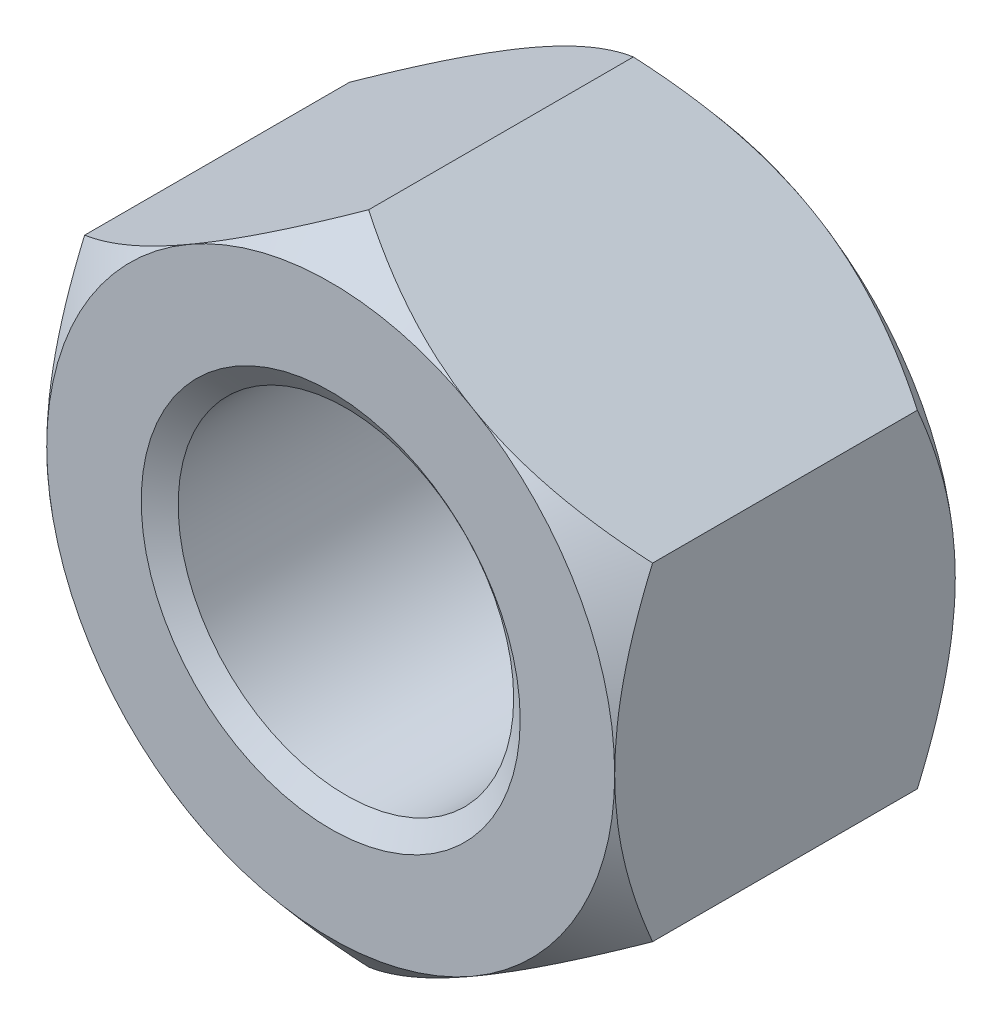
ISO-10303-21;
HEADER;
FILE_DESCRIPTION(('STEP AP214'),'2;1');
FILE_NAME('part.step','',(''),(''),'','','');
FILE_SCHEMA(('AUTOMOTIVE_DESIGN { 1 0 10303 214 1 1 1 1 }'));
ENDSEC;
DATA;
#1=APPLICATION_CONTEXT('core data for automotive mechanical design processes');
#2=APPLICATION_PROTOCOL_DEFINITION('international standard','automotive_design',2000,#1);
#3=PRODUCT_CONTEXT('',#1,'mechanical');
#4=PRODUCT('Part','Part','',(#3));
#5=PRODUCT_RELATED_PRODUCT_CATEGORY('part','',(#4));
#6=PRODUCT_DEFINITION_FORMATION('','',#4);
#7=PRODUCT_DEFINITION_CONTEXT('part definition',#1,'design');
#8=PRODUCT_DEFINITION('design','',#6,#7);
#9=PRODUCT_DEFINITION_SHAPE('','',#8);
#10=(LENGTH_UNIT() NAMED_UNIT(*) SI_UNIT(.MILLI.,.METRE.));
#11=(NAMED_UNIT(*) PLANE_ANGLE_UNIT() SI_UNIT($,.RADIAN.));
#12=(NAMED_UNIT(*) SI_UNIT($,.STERADIAN.) SOLID_ANGLE_UNIT());
#13=UNCERTAINTY_MEASURE_WITH_UNIT(LENGTH_MEASURE(1.E-05),#10,'distance_accuracy_value','');
#14=(GEOMETRIC_REPRESENTATION_CONTEXT(3) GLOBAL_UNCERTAINTY_ASSIGNED_CONTEXT((#13)) GLOBAL_UNIT_ASSIGNED_CONTEXT((#10,
#11,#12)) REPRESENTATION_CONTEXT('',''));
#15=CARTESIAN_POINT('',(0.,0.,0.));
#16=DIRECTION('',(0.,0.,1.));
#17=DIRECTION('',(1.,0.,0.));
#18=AXIS2_PLACEMENT_3D('',#15,#16,#17);
#19=CARTESIAN_POINT('',(0.,0.,-8.5598));
#20=DIRECTION('',(0.,0.,1.));
#21=DIRECTION('',(1.,0.,0.));
#22=AXIS2_PLACEMENT_3D('',#19,#20,#21);
#23=CYLINDRICAL_SURFACE('',#22,4.2164);
#24=CARTESIAN_POINT('',(0.,0.,-0.382383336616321));
#25=DIRECTION('',(0.,0.,1.));
#26=DIRECTION('',(1.,0.,0.));
#27=AXIS2_PLACEMENT_3D('',#24,#25,#26);
#28=CIRCLE('',#27,4.2164);
#29=CARTESIAN_POINT('',(4.2164,0.,-0.382383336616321));
#30=VERTEX_POINT('',#29);
#31=EDGE_CURVE('E173',#30,#30,#28,.F.);
#32=ORIENTED_EDGE('',*,*,#31,.F.);
#33=EDGE_LOOP('',(#32));
#34=FACE_BOUND('',#33,.T.);
#35=CARTESIAN_POINT('',(0.,0.,-8.15201666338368));
#36=DIRECTION('',(0.,0.,-1.));
#37=DIRECTION('',(-1.,0.,0.));
#38=AXIS2_PLACEMENT_3D('',#35,#36,#37);
#39=CIRCLE('',#38,4.2164);
#40=CARTESIAN_POINT('',(-4.2164,0.,-8.15201666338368));
#41=VERTEX_POINT('',#40);
#42=EDGE_CURVE('E37',#41,#41,#39,.F.);
#43=ORIENTED_EDGE('',*,*,#42,.F.);
#44=EDGE_LOOP('',(#43));
#45=FACE_BOUND('',#44,.T.);
#46=ADVANCED_FACE('F32',(#34,#45),#23,.F.);
#47=CARTESIAN_POINT('',(-14.2748,0.,-8.5598));
#48=DIRECTION('',(0.,0.,1.));
#49=DIRECTION('',(1.,0.,0.));
#50=AXIS2_PLACEMENT_3D('',#47,#48,#49);
#51=PLANE('',#50);
#52=CARTESIAN_POINT('',(0.,0.,-8.5598));
#53=DIRECTION('',(0.,0.,1.));
#54=DIRECTION('',(1.,0.,0.));
#55=AXIS2_PLACEMENT_3D('',#52,#53,#54);
#56=CIRCLE('',#55,7.1374);
#57=CARTESIAN_POINT('',(7.1374,0.,-8.5598));
#58=VERTEX_POINT('',#57);
#59=CARTESIAN_POINT('',(3.56870000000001,6.18116971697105,-8.5598));
#60=VERTEX_POINT('',#59);
#61=EDGE_CURVE('E243',#58,#60,#56,.T.);
#62=ORIENTED_EDGE('',*,*,#61,.F.);
#63=CARTESIAN_POINT('',(0.,0.,-8.5598));
#64=DIRECTION('',(0.,0.,1.));
#65=DIRECTION('',(1.,0.,0.));
#66=AXIS2_PLACEMENT_3D('',#63,#64,#65);
#67=CIRCLE('',#66,7.1374);
#68=CARTESIAN_POINT('',(3.56870000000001,-6.18116971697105,-8.5598));
#69=VERTEX_POINT('',#68);
#70=EDGE_CURVE('E167',#58,#69,#67,.F.);
#71=ORIENTED_EDGE('',*,*,#70,.T.);
#72=CARTESIAN_POINT('',(-3.56870000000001,-6.18116971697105,-8.5598));
#73=VERTEX_POINT('',#72);
#74=EDGE_CURVE('E169',#69,#73,#67,.F.);
#75=ORIENTED_EDGE('',*,*,#74,.T.);
#76=CARTESIAN_POINT('',(-7.1374,0.,-8.5598));
#77=VERTEX_POINT('',#76);
#78=EDGE_CURVE('E400',#73,#77,#67,.F.);
#79=ORIENTED_EDGE('',*,*,#78,.T.);
#80=CARTESIAN_POINT('',(-3.56870000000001,6.18116971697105,-8.5598));
#81=VERTEX_POINT('',#80);
#82=EDGE_CURVE('E402',#77,#81,#67,.F.);
#83=ORIENTED_EDGE('',*,*,#82,.T.);
#84=EDGE_CURVE('E151',#81,#60,#67,.F.);
#85=ORIENTED_EDGE('',*,*,#84,.T.);
#86=EDGE_LOOP('',(#62,#71,#75,#79,#83,#85));
#87=FACE_BOUND('',#86,.T.);
#88=CARTESIAN_POINT('',(0.,0.,-8.5598));
#89=DIRECTION('',(0.,0.,1.));
#90=DIRECTION('',(1.,0.,0.));
#91=AXIS2_PLACEMENT_3D('',#88,#89,#90);
#92=CIRCLE('',#91,4.7625);
#93=CARTESIAN_POINT('',(4.7625,0.,-8.5598));
#94=VERTEX_POINT('',#93);
#95=EDGE_CURVE('E176',#94,#94,#92,.F.);
#96=ORIENTED_EDGE('',*,*,#95,.F.);
#97=EDGE_LOOP('',(#96));
#98=FACE_BOUND('',#97,.T.);
#99=ADVANCED_FACE('F295',(#87,#98),#51,.F.);
#100=CARTESIAN_POINT('',(-14.2748,0.,0.));
#101=DIRECTION('',(0.,0.,1.));
#102=DIRECTION('',(1.,0.,0.));
#103=AXIS2_PLACEMENT_3D('',#100,#101,#102);
#104=PLANE('',#103);
#105=CARTESIAN_POINT('',(0.,0.,0.));
#106=DIRECTION('',(0.,0.,1.));
#107=DIRECTION('',(1.,0.,0.));
#108=AXIS2_PLACEMENT_3D('',#105,#106,#107);
#109=CIRCLE('',#108,7.1374);
#110=CARTESIAN_POINT('',(3.56870000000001,-6.18116971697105,0.));
#111=VERTEX_POINT('',#110);
#112=CARTESIAN_POINT('',(7.1374,0.,0.));
#113=VERTEX_POINT('',#112);
#114=EDGE_CURVE('E44',#111,#113,#109,.T.);
#115=ORIENTED_EDGE('',*,*,#114,.T.);
#116=CARTESIAN_POINT('',(0.,0.,0.));
#117=DIRECTION('',(0.,0.,1.));
#118=DIRECTION('',(1.,0.,0.));
#119=AXIS2_PLACEMENT_3D('',#116,#117,#118);
#120=CIRCLE('',#119,7.1374);
#121=CARTESIAN_POINT('',(3.56870000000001,6.18116971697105,0.));
#122=VERTEX_POINT('',#121);
#123=EDGE_CURVE('E51',#113,#122,#120,.T.);
#124=ORIENTED_EDGE('',*,*,#123,.T.);
#125=CARTESIAN_POINT('',(-3.56870000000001,6.18116971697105,0.));
#126=VERTEX_POINT('',#125);
#127=EDGE_CURVE('E11',#122,#126,#109,.T.);
#128=ORIENTED_EDGE('',*,*,#127,.T.);
#129=CARTESIAN_POINT('',(-7.1374,0.,0.));
#130=VERTEX_POINT('',#129);
#131=EDGE_CURVE('E42',#126,#130,#109,.T.);
#132=ORIENTED_EDGE('',*,*,#131,.T.);
#133=CARTESIAN_POINT('',(-3.56870000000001,-6.18116971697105,0.));
#134=VERTEX_POINT('',#133);
#135=EDGE_CURVE('E346',#130,#134,#109,.T.);
#136=ORIENTED_EDGE('',*,*,#135,.T.);
#137=EDGE_CURVE('E172',#134,#111,#109,.T.);
#138=ORIENTED_EDGE('',*,*,#137,.T.);
#139=EDGE_LOOP('',(#115,#124,#128,#132,#136,#138));
#140=FACE_BOUND('',#139,.T.);
#141=CARTESIAN_POINT('',(0.,0.,0.));
#142=DIRECTION('',(0.,0.,1.));
#143=DIRECTION('',(1.,0.,0.));
#144=AXIS2_PLACEMENT_3D('',#141,#142,#143);
#145=CIRCLE('',#144,4.7625);
#146=CARTESIAN_POINT('',(4.7625,0.,0.));
#147=VERTEX_POINT('',#146);
#148=EDGE_CURVE('E175',#147,#147,#145,.T.);
#149=ORIENTED_EDGE('',*,*,#148,.F.);
#150=EDGE_LOOP('',(#149));
#151=FACE_BOUND('',#150,.T.);
#152=ADVANCED_FACE('F248',(#140,#151),#104,.T.);
#153=CARTESIAN_POINT('',(0.,8.24155962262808,-8.5598));
#154=DIRECTION('',(-0.500000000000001,0.866025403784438,0.));
#155=DIRECTION('',(-0.866025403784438,-0.500000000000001,0.));
#156=AXIS2_PLACEMENT_3D('',#153,#154,#155);
#157=PLANE('',#156);
#158=DIRECTION('',(0.,0.,1.));
#159=VECTOR('',#158,1.);
#160=CARTESIAN_POINT('',(-7.1374,4.12077981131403,-8.5598));
#161=LINE('',#160,#159);
#162=CARTESIAN_POINT('',(-7.1374,4.12077981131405,-7.6073));
#163=VERTEX_POINT('',#162);
#164=CARTESIAN_POINT('',(-7.1374,4.12077981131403,-0.952499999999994));
#165=VERTEX_POINT('',#164);
#166=EDGE_CURVE('E163',#163,#165,#161,.T.);
#167=ORIENTED_EDGE('',*,*,#166,.T.);
#168=CARTESIAN_POINT('',(-7.1376,4.12066434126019,-0.952599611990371));
#169=CARTESIAN_POINT('',(-6.99772936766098,4.20141868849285,-0.882951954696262));
#170=CARTESIAN_POINT('',(-6.85691392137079,4.28271852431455,-0.815871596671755));
#171=CARTESIAN_POINT('',(-6.57317892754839,4.44653299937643,-0.687649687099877));
#172=CARTESIAN_POINT('',(-6.43025819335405,4.52904832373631,-0.626511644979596));
#173=CARTESIAN_POINT('',(-5.99690370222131,4.77924565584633,-0.452792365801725));
#174=CARTESIAN_POINT('',(-5.70319714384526,4.9488172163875,-0.350580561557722));
#175=CARTESIAN_POINT('',(-5.25966772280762,5.2048890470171,-0.224711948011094));
#176=CARTESIAN_POINT('',(-5.11266966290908,5.28975841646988,-0.187546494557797));
#177=CARTESIAN_POINT('',(-4.81712495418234,5.46039123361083,-0.122687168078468));
#178=CARTESIAN_POINT('',(-4.66857866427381,5.54615447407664,-0.0949911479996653));
#179=CARTESIAN_POINT('',(-4.37062850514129,5.7181760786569,-0.0498719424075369));
#180=CARTESIAN_POINT('',(-4.22122705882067,5.80443304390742,-0.032427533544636));
#181=CARTESIAN_POINT('',(-3.9217766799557,5.97732080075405,-0.00824572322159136));
#182=CARTESIAN_POINT('',(-3.77172779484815,6.0639515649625,-0.00150755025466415));
#183=CARTESIAN_POINT('',(-3.49251730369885,6.22515381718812,0.000876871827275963));
#184=CARTESIAN_POINT('',(-3.36336331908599,6.29972090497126,-0.00206006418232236));
#185=CARTESIAN_POINT('',(-3.10536355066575,6.44867714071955,-0.015940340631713));
#186=CARTESIAN_POINT('',(-2.97651780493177,6.523066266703,-0.0268846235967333));
#187=CARTESIAN_POINT('',(-2.71942449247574,6.67149915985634,-0.0565424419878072));
#188=CARTESIAN_POINT('',(-2.59117732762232,6.74554269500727,-0.0752605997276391));
#189=CARTESIAN_POINT('',(-2.33564422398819,6.8930748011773,-0.1200622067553));
#190=CARTESIAN_POINT('',(-2.2083584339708,6.96656328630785,-0.146146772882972));
#191=CARTESIAN_POINT('',(-1.82829381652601,7.18599369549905,-0.234706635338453));
#192=CARTESIAN_POINT('',(-1.57728830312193,7.33091179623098,-0.307490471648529));
#193=CARTESIAN_POINT('',(-1.08128197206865,7.61728118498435,-0.475766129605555));
#194=CARTESIAN_POINT('',(-0.836279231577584,7.75873358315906,-0.571250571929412));
#195=CARTESIAN_POINT('',(-0.494067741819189,7.95630947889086,-0.719062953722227));
#196=CARTESIAN_POINT('',(-0.394372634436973,8.01386847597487,-0.763897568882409));
#197=CARTESIAN_POINT('',(-0.196230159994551,8.1282660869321,-0.856270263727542));
#198=CARTESIAN_POINT('',(-0.097780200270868,8.18510619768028,-0.903800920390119));
#199=CARTESIAN_POINT('',(0.000200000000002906,8.24167509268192,-0.952599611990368));
#200=B_SPLINE_CURVE_WITH_KNOTS('',3,(#168,#169,#170,#171,#172,#173,#174,#175,#176,#177,#178,
#179,#180,#181,#182,#183,#184,#185,#186,#187,#188,#189,#190,#191,#192,#193,#194,#195,#196,#197,
#198,#199),.UNSPECIFIED.,.F.,.F.,(4,2,2,2,2,2,2,2,2,2,2,2,2,2,2,4),(0.,0.527589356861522,
1.05548842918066,2.11627342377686,2.63733905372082,3.15828646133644,3.67815154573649,
4.19797916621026,4.64525595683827,5.09258540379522,5.54018121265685,5.98784491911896,
6.88310490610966,7.77807426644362,8.14866892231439,8.51828856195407),.UNSPECIFIED.);
#201=EDGE_CURVE('E59',#165,#126,#200,.T.);
#202=ORIENTED_EDGE('',*,*,#201,.T.);
#203=CARTESIAN_POINT('',(0.,8.24155962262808,-0.952500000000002));
#204=VERTEX_POINT('',#203);
#205=EDGE_CURVE('E237',#126,#204,#200,.T.);
#206=ORIENTED_EDGE('',*,*,#205,.T.);
#207=DIRECTION('',(0.,0.,1.));
#208=VECTOR('',#207,1.);
#209=CARTESIAN_POINT('',(0.,8.24155962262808,-8.5598));
#210=LINE('',#209,#208);
#211=CARTESIAN_POINT('',(0.,8.24155962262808,-7.6073));
#212=VERTEX_POINT('',#211);
#213=EDGE_CURVE('E148',#212,#204,#210,.T.);
#214=ORIENTED_EDGE('',*,*,#213,.F.);
#215=CARTESIAN_POINT('',(-7.1376,4.12066434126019,-7.60720038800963));
#216=CARTESIAN_POINT('',(-6.99772936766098,4.20141868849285,-7.67684804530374));
#217=CARTESIAN_POINT('',(-6.85691392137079,4.28271852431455,-7.74392840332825));
#218=CARTESIAN_POINT('',(-6.57317892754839,4.44653299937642,-7.87215031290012));
#219=CARTESIAN_POINT('',(-6.43025819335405,4.52904832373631,-7.9332883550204));
#220=CARTESIAN_POINT('',(-5.99690370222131,4.77924565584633,-8.10700763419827));
#221=CARTESIAN_POINT('',(-5.70319714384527,4.9488172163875,-8.20921943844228));
#222=CARTESIAN_POINT('',(-5.25966772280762,5.2048890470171,-8.33508805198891));
#223=CARTESIAN_POINT('',(-5.11266966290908,5.28975841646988,-8.3722535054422));
#224=CARTESIAN_POINT('',(-4.81712495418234,5.46039123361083,-8.43711283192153));
#225=CARTESIAN_POINT('',(-4.66857866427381,5.54615447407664,-8.46480885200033));
#226=CARTESIAN_POINT('',(-4.37062850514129,5.71817607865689,-8.50992805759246));
#227=CARTESIAN_POINT('',(-4.22122705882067,5.80443304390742,-8.52737246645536));
#228=CARTESIAN_POINT('',(-3.9217766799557,5.97732080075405,-8.55155427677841));
#229=CARTESIAN_POINT('',(-3.77172779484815,6.0639515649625,-8.55829244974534));
#230=CARTESIAN_POINT('',(-3.49251730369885,6.22515381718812,-8.56067687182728));
#231=CARTESIAN_POINT('',(-3.36336331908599,6.29972090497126,-8.55773993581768));
#232=CARTESIAN_POINT('',(-3.10536355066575,6.44867714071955,-8.54385965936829));
#233=CARTESIAN_POINT('',(-2.97651780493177,6.523066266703,-8.53291537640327));
#234=CARTESIAN_POINT('',(-2.71942449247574,6.67149915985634,-8.50325755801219));
#235=CARTESIAN_POINT('',(-2.59117732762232,6.74554269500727,-8.48453940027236));
#236=CARTESIAN_POINT('',(-2.33564422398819,6.8930748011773,-8.4397377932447));
#237=CARTESIAN_POINT('',(-2.2083584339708,6.96656328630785,-8.41365322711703));
#238=CARTESIAN_POINT('',(-1.82829381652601,7.18599369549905,-8.32509336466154));
#239=CARTESIAN_POINT('',(-1.57728830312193,7.33091179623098,-8.25230952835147));
#240=CARTESIAN_POINT('',(-1.08128197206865,7.61728118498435,-8.08403387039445));
#241=CARTESIAN_POINT('',(-0.836279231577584,7.75873358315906,-7.98854942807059));
#242=CARTESIAN_POINT('',(-0.494067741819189,7.95630947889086,-7.84073704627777));
#243=CARTESIAN_POINT('',(-0.394372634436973,8.01386847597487,-7.79590243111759));
#244=CARTESIAN_POINT('',(-0.196230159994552,8.1282660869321,-7.70352973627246));
#245=CARTESIAN_POINT('',(-0.0977802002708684,8.18510619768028,-7.65599907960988));
#246=CARTESIAN_POINT('',(0.000200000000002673,8.24167509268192,-7.60720038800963));
#247=B_SPLINE_CURVE_WITH_KNOTS('',3,(#215,#216,#217,#218,#219,#220,#221,#222,#223,#224,#225,
#226,#227,#228,#229,#230,#231,#232,#233,#234,#235,#236,#237,#238,#239,#240,#241,#242,#243,#244,
#245,#246),.UNSPECIFIED.,.F.,.F.,(4,2,2,2,2,2,2,2,2,2,2,2,2,2,2,4),(0.,0.52758935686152,
1.05548842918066,2.11627342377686,2.63733905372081,3.15828646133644,3.67815154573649,
4.19797916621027,4.64525595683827,5.09258540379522,5.54018121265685,5.98784491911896,
6.88310490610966,7.77807426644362,8.14866892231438,8.51828856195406),.UNSPECIFIED.);
#248=EDGE_CURVE('E166',#81,#212,#247,.T.);
#249=ORIENTED_EDGE('',*,*,#248,.F.);
#250=EDGE_CURVE('E258',#163,#81,#247,.T.);
#251=ORIENTED_EDGE('',*,*,#250,.F.);
#252=EDGE_LOOP('',(#167,#202,#206,#214,#249,#251));
#253=FACE_BOUND('',#252,.T.);
#254=ADVANCED_FACE('F34',(#253),#157,.T.);
#255=CARTESIAN_POINT('',(7.1374,4.12077981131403,-8.5598));
#256=DIRECTION('',(0.500000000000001,0.866025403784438,0.));
#257=DIRECTION('',(-0.866025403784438,0.500000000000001,0.));
#258=AXIS2_PLACEMENT_3D('',#255,#256,#257);
#259=PLANE('',#258);
#260=ORIENTED_EDGE('',*,*,#213,.T.);
#261=CARTESIAN_POINT('',(-0.00020000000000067,8.24167509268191,-0.952599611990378));
#262=CARTESIAN_POINT('',(0.139670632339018,8.16092074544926,-0.882951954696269));
#263=CARTESIAN_POINT('',(0.280486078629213,8.07962090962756,-0.815871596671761));
#264=CARTESIAN_POINT('',(0.564221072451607,7.91580643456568,-0.687649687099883));
#265=CARTESIAN_POINT('',(0.707141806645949,7.8332911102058,-0.626511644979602));
#266=CARTESIAN_POINT('',(1.14049629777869,7.58309377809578,-0.452792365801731));
#267=CARTESIAN_POINT('',(1.43420285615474,7.41352221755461,-0.350580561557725));
#268=CARTESIAN_POINT('',(1.87773227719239,7.157450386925,-0.224711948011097));
#269=CARTESIAN_POINT('',(2.02473033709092,7.07258101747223,-0.187546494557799));
#270=CARTESIAN_POINT('',(2.32027504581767,6.90194820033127,-0.122687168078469));
#271=CARTESIAN_POINT('',(2.46882133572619,6.81618495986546,-0.0949911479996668));
#272=CARTESIAN_POINT('',(2.76677149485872,6.64416335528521,-0.0498719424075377));
#273=CARTESIAN_POINT('',(2.91617294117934,6.55790639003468,-0.032427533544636));
#274=CARTESIAN_POINT('',(3.21562332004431,6.38501863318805,-0.00824572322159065));
#275=CARTESIAN_POINT('',(3.36567220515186,6.2983878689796,-0.00150755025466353));
#276=CARTESIAN_POINT('',(3.64488269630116,6.13718561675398,0.000876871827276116));
#277=CARTESIAN_POINT('',(3.77403668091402,6.06261852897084,-0.00206006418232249));
#278=CARTESIAN_POINT('',(4.03203644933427,5.91366229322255,-0.0159403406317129));
#279=CARTESIAN_POINT('',(4.16088219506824,5.8392731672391,-0.0268846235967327));
#280=CARTESIAN_POINT('',(4.41797550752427,5.69084027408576,-0.0565424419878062));
#281=CARTESIAN_POINT('',(4.54622267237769,5.61679673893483,-0.0752605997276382));
#282=CARTESIAN_POINT('',(4.80175577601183,5.4692646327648,-0.120062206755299));
#283=CARTESIAN_POINT('',(4.92904156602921,5.39577614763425,-0.146146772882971));
#284=CARTESIAN_POINT('',(5.309106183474,5.17634573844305,-0.234706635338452));
#285=CARTESIAN_POINT('',(5.56011169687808,5.03142763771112,-0.307490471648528));
#286=CARTESIAN_POINT('',(6.05611802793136,4.74505824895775,-0.475766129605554));
#287=CARTESIAN_POINT('',(6.30112076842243,4.60360585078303,-0.571250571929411));
#288=CARTESIAN_POINT('',(6.64333225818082,4.40602995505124,-0.719062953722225));
#289=CARTESIAN_POINT('',(6.74302736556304,4.34847095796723,-0.763897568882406));
#290=CARTESIAN_POINT('',(6.94116984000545,4.23407334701,-0.856270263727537));
#291=CARTESIAN_POINT('',(7.03961979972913,4.17723323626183,-0.903800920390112));
#292=CARTESIAN_POINT('',(7.1376,4.12066434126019,-0.952599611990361));
#293=B_SPLINE_CURVE_WITH_KNOTS('',3,(#261,#262,#263,#264,#265,#266,#267,#268,#269,#270,#271,
#272,#273,#274,#275,#276,#277,#278,#279,#280,#281,#282,#283,#284,#285,#286,#287,#288,#289,#290,
#291,#292),.UNSPECIFIED.,.F.,.F.,(4,2,2,2,2,2,2,2,2,2,2,2,2,2,2,4),(0.,0.527589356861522,
1.05548842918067,2.11627342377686,2.63733905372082,3.15828646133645,3.6781515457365,
4.19797916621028,4.64525595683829,5.09258540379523,5.54018121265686,5.98784491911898,
6.88310490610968,7.77807426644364,8.1486689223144,8.51828856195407),.UNSPECIFIED.);
#294=EDGE_CURVE('E141',#204,#122,#293,.T.);
#295=ORIENTED_EDGE('',*,*,#294,.T.);
#296=CARTESIAN_POINT('',(7.1374,4.12077981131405,-0.952500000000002));
#297=VERTEX_POINT('',#296);
#298=EDGE_CURVE('E127',#122,#297,#293,.T.);
#299=ORIENTED_EDGE('',*,*,#298,.T.);
#300=DIRECTION('',(0.,0.,1.));
#301=VECTOR('',#300,1.);
#302=CARTESIAN_POINT('',(7.1374,4.12077981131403,-8.5598));
#303=LINE('',#302,#301);
#304=CARTESIAN_POINT('',(7.1374,4.12077981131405,-7.6073));
#305=VERTEX_POINT('',#304);
#306=EDGE_CURVE('E140',#305,#297,#303,.T.);
#307=ORIENTED_EDGE('',*,*,#306,.F.);
#308=CARTESIAN_POINT('',(-0.00020000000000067,8.24167509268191,-7.60720038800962));
#309=CARTESIAN_POINT('',(0.139670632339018,8.16092074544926,-7.67684804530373));
#310=CARTESIAN_POINT('',(0.280486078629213,8.07962090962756,-7.74392840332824));
#311=CARTESIAN_POINT('',(0.564221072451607,7.91580643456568,-7.87215031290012));
#312=CARTESIAN_POINT('',(0.707141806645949,7.8332911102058,-7.9332883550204));
#313=CARTESIAN_POINT('',(1.14049629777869,7.58309377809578,-8.10700763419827));
#314=CARTESIAN_POINT('',(1.43420285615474,7.41352221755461,-8.20921943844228));
#315=CARTESIAN_POINT('',(1.87773227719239,7.157450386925,-8.3350880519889));
#316=CARTESIAN_POINT('',(2.02473033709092,7.07258101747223,-8.3722535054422));
#317=CARTESIAN_POINT('',(2.32027504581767,6.90194820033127,-8.43711283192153));
#318=CARTESIAN_POINT('',(2.46882133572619,6.81618495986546,-8.46480885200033));
#319=CARTESIAN_POINT('',(2.76677149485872,6.64416335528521,-8.50992805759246));
#320=CARTESIAN_POINT('',(2.91617294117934,6.55790639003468,-8.52737246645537));
#321=CARTESIAN_POINT('',(3.21562332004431,6.38501863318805,-8.55155427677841));
#322=CARTESIAN_POINT('',(3.36567220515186,6.2983878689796,-8.55829244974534));
#323=CARTESIAN_POINT('',(3.64488269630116,6.13718561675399,-8.56067687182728));
#324=CARTESIAN_POINT('',(3.77403668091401,6.06261852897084,-8.55773993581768));
#325=CARTESIAN_POINT('',(4.03203644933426,5.91366229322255,-8.54385965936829));
#326=CARTESIAN_POINT('',(4.16088219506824,5.8392731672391,-8.53291537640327));
#327=CARTESIAN_POINT('',(4.41797550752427,5.69084027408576,-8.5032575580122));
#328=CARTESIAN_POINT('',(4.54622267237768,5.61679673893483,-8.48453940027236));
#329=CARTESIAN_POINT('',(4.80175577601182,5.4692646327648,-8.4397377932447));
#330=CARTESIAN_POINT('',(4.92904156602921,5.39577614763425,-8.41365322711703));
#331=CARTESIAN_POINT('',(5.309106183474,5.17634573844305,-8.32509336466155));
#332=CARTESIAN_POINT('',(5.56011169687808,5.03142763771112,-8.25230952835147));
#333=CARTESIAN_POINT('',(6.05611802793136,4.74505824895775,-8.08403387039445));
#334=CARTESIAN_POINT('',(6.30112076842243,4.60360585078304,-7.98854942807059));
#335=CARTESIAN_POINT('',(6.64333225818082,4.40602995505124,-7.84073704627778));
#336=CARTESIAN_POINT('',(6.74302736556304,4.34847095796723,-7.7959024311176));
#337=CARTESIAN_POINT('',(6.94116984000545,4.23407334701,-7.70352973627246));
#338=CARTESIAN_POINT('',(7.03961979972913,4.17723323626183,-7.65599907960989));
#339=CARTESIAN_POINT('',(7.1376,4.12066434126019,-7.60720038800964));
#340=B_SPLINE_CURVE_WITH_KNOTS('',3,(#308,#309,#310,#311,#312,#313,#314,#315,#316,#317,#318,
#319,#320,#321,#322,#323,#324,#325,#326,#327,#328,#329,#330,#331,#332,#333,#334,#335,#336,#337,
#338,#339),.UNSPECIFIED.,.F.,.F.,(4,2,2,2,2,2,2,2,2,2,2,2,2,2,2,4),(0.,0.527589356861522,
1.05548842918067,2.11627342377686,2.63733905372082,3.15828646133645,3.6781515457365,
4.19797916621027,4.64525595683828,5.09258540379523,5.54018121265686,5.98784491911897,
6.88310490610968,7.77807426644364,8.1486689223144,8.51828856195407),.UNSPECIFIED.);
#341=EDGE_CURVE('E252',#60,#305,#340,.T.);
#342=ORIENTED_EDGE('',*,*,#341,.F.);
#343=EDGE_CURVE('E257',#212,#60,#340,.T.);
#344=ORIENTED_EDGE('',*,*,#343,.F.);
#345=EDGE_LOOP('',(#260,#295,#299,#307,#342,#344));
#346=FACE_BOUND('',#345,.T.);
#347=ADVANCED_FACE('F138',(#346),#259,.T.);
#348=CARTESIAN_POINT('',(7.1374,4.12077981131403,-8.5598));
#349=DIRECTION('',(-1.,0.,0.));
#350=DIRECTION('',(0.,0.,1.));
#351=AXIS2_PLACEMENT_3D('',#348,#349,#350);
#352=PLANE('',#351);
#353=CARTESIAN_POINT('',(7.1374,-9.11813067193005,-3.83188851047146));
#354=CARTESIAN_POINT('',(7.1374,-8.88751020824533,-3.67526826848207));
#355=CARTESIAN_POINT('',(7.1374,-8.65586208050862,-3.52013672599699));
#356=CARTESIAN_POINT('',(7.1374,-8.19006842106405,-3.21356007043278));
#357=CARTESIAN_POINT('',(7.1374,-7.955922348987,-3.06211577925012));
#358=CARTESIAN_POINT('',(7.1374,-7.48312079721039,-2.76263376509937));
#359=CARTESIAN_POINT('',(7.1374,-7.24444510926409,-2.61462783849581));
#360=CARTESIAN_POINT('',(7.1374,-6.76374157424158,-2.32418178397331));
#361=CARTESIAN_POINT('',(7.1374,-6.52171393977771,-2.18174130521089));
#362=CARTESIAN_POINT('',(7.1374,-6.02047832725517,-1.89617265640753));
#363=CARTESIAN_POINT('',(7.1374,-5.76105114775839,-1.7534272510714));
#364=CARTESIAN_POINT('',(7.1374,-5.23705537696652,-1.47754652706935));
#365=CARTESIAN_POINT('',(7.1374,-4.97248603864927,-1.34441261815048));
#366=CARTESIAN_POINT('',(7.1374,-4.43820716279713,-1.09074646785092));
#367=CARTESIAN_POINT('',(7.1374,-4.16851358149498,-0.970180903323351));
#368=CARTESIAN_POINT('',(7.1374,-3.6227434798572,-0.744627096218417));
#369=CARTESIAN_POINT('',(7.1374,-3.34666965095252,-0.639632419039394));
#370=CARTESIAN_POINT('',(7.1374,-2.79570741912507,-0.451984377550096));
#371=CARTESIAN_POINT('',(7.1374,-2.52100944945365,-0.368779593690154));
#372=CARTESIAN_POINT('',(7.1374,-1.9656230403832,-0.225136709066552));
#373=CARTESIAN_POINT('',(7.1374,-1.68493485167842,-0.16469765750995));
#374=CARTESIAN_POINT('',(7.1374,-1.12429603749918,-0.0714921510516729));
#375=CARTESIAN_POINT('',(7.1374,-0.844429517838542,-0.0382300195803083));
#376=CARTESIAN_POINT('',(7.1374,-0.282749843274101,-0.000100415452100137));
#377=CARTESIAN_POINT('',(7.1374,-0.000936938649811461,0.00477064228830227));
#378=CARTESIAN_POINT('',(7.1374,0.54290439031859,-0.0136324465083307));
#379=CARTESIAN_POINT('',(7.1374,0.804998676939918,-0.0350509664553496));
#380=CARTESIAN_POINT('',(7.1374,1.3261499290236,-0.101426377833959));
#381=CARTESIAN_POINT('',(7.1374,1.58520664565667,-0.146385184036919));
#382=CARTESIAN_POINT('',(7.1374,2.10413184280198,-0.258239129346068));
#383=CARTESIAN_POINT('',(7.1374,2.36390490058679,-0.325571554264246));
#384=CARTESIAN_POINT('',(7.1374,2.74938245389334,-0.440191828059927));
#385=CARTESIAN_POINT('',(7.1374,2.87717361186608,-0.480667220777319));
#386=CARTESIAN_POINT('',(7.1374,3.13137501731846,-0.565740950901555));
#387=CARTESIAN_POINT('',(7.1374,3.25778530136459,-0.610339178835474));
#388=CARTESIAN_POINT('',(7.1374,3.61295999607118,-0.741581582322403));
#389=CARTESIAN_POINT('',(7.1374,3.84012744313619,-0.832558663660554));
#390=CARTESIAN_POINT('',(7.1374,4.29014625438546,-1.02468497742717));
#391=CARTESIAN_POINT('',(7.1374,4.5129963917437,-1.12583705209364));
#392=CARTESIAN_POINT('',(7.1374,4.95495678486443,-1.3365670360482));
#393=CARTESIAN_POINT('',(7.1374,5.17406267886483,-1.44615404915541));
#394=CARTESIAN_POINT('',(7.1374,5.60869144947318,-1.67214028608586));
#395=CARTESIAN_POINT('',(7.1374,5.82421462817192,-1.78853893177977));
#396=CARTESIAN_POINT('',(7.1374,6.25340773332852,-2.02766738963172));
#397=CARTESIAN_POINT('',(7.1374,6.46705873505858,-2.15043104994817));
#398=CARTESIAN_POINT('',(7.1374,6.89159234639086,-2.40066720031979));
#399=CARTESIAN_POINT('',(7.1374,7.10247480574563,-2.52813994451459));
#400=CARTESIAN_POINT('',(7.1374,7.52169108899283,-2.78692846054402));
#401=CARTESIAN_POINT('',(7.1374,7.73002634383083,-2.91824191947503));
#402=CARTESIAN_POINT('',(7.1374,8.14458628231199,-3.18416304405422));
#403=CARTESIAN_POINT('',(7.1374,8.35081091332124,-3.31877079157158));
#404=CARTESIAN_POINT('',(7.1374,8.92629334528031,-3.69997531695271));
#405=CARTESIAN_POINT('',(7.1374,9.29348142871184,-3.94969689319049));
#406=CARTESIAN_POINT('',(7.1374,10.0231850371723,-4.45594933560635));
#407=CARTESIAN_POINT('',(7.1374,10.3856998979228,-4.71248115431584));
#408=CARTESIAN_POINT('',(7.1374,11.1022031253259,-5.22735562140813));
#409=CARTESIAN_POINT('',(7.1374,11.4562408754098,-5.48562965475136));
#410=CARTESIAN_POINT('',(7.1374,11.98502253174,-5.87601781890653));
#411=CARTESIAN_POINT('',(7.1374,12.1608815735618,-6.00662649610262));
#412=CARTESIAN_POINT('',(7.1374,12.5119245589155,-6.26874447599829));
#413=CARTESIAN_POINT('',(7.1374,12.6871085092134,-6.40025376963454));
#414=CARTESIAN_POINT('',(7.1374,12.8619905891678,-6.53216352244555));
#415=B_SPLINE_CURVE_WITH_KNOTS('',3,(#353,#354,#355,#356,#357,#358,#359,#360,#361,#362,#363,
#364,#365,#366,#367,#368,#369,#370,#371,#372,#373,#374,#375,#376,#377,#378,#379,#380,#381,#382,
#383,#384,#385,#386,#387,#388,#389,#390,#391,#392,#393,#394,#395,#396,#397,#398,#399,#400,#401,
#402,#403,#404,#405,#406,#407,#408,#409,#410,#411,#412,#413,#414),.UNSPECIFIED.,.F.,.F.,(4,2,2,
2,2,2,2,2,2,2,2,2,2,2,2,2,2,2,2,2,2,2,2,2,2,2,2,2,2,2,4),(0.,0.836340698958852,1.67286614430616,
2.51532722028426,3.35773510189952,4.24589268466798,5.13418027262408,6.02004935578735,
6.90555133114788,7.76581790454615,8.62604854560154,9.4702154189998,10.3142756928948,
11.1020367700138,11.8898619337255,12.6940919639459,13.0961791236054,13.4982556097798,
14.2320494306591,14.9660487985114,15.7008517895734,16.4355925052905,17.1747493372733,
17.9139461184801,18.6527065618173,19.3914853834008,20.7235468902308,22.055795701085,
23.3704566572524,24.0276190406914,24.6847748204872),.UNSPECIFIED.);
#416=CARTESIAN_POINT('',(7.1374,-4.12077981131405,-0.952500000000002));
#417=VERTEX_POINT('',#416);
#418=EDGE_CURVE('E133',#417,#113,#415,.T.);
#419=ORIENTED_EDGE('',*,*,#418,.F.);
#420=DIRECTION('',(0.,0.,1.));
#421=VECTOR('',#420,1.);
#422=CARTESIAN_POINT('',(7.1374,-4.12077981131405,-8.5598));
#423=LINE('',#422,#421);
#424=CARTESIAN_POINT('',(7.1374,-4.12077981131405,-7.6073));
#425=VERTEX_POINT('',#424);
#426=EDGE_CURVE('E149',#425,#417,#423,.T.);
#427=ORIENTED_EDGE('',*,*,#426,.F.);
#428=CARTESIAN_POINT('',(7.1374,-9.11813067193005,-4.72791148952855));
#429=CARTESIAN_POINT('',(7.1374,-8.88751020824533,-4.88453173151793));
#430=CARTESIAN_POINT('',(7.1374,-8.65586208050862,-5.03966327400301));
#431=CARTESIAN_POINT('',(7.1374,-8.19006842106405,-5.34623992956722));
#432=CARTESIAN_POINT('',(7.1374,-7.955922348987,-5.49768422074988));
#433=CARTESIAN_POINT('',(7.1374,-7.48312079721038,-5.79716623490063));
#434=CARTESIAN_POINT('',(7.1374,-7.24444510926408,-5.9451721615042));
#435=CARTESIAN_POINT('',(7.1374,-6.76374157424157,-6.23561821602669));
#436=CARTESIAN_POINT('',(7.1374,-6.52171393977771,-6.37805869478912));
#437=CARTESIAN_POINT('',(7.1374,-6.02047832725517,-6.66362734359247));
#438=CARTESIAN_POINT('',(7.1374,-5.76105114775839,-6.80637274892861));
#439=CARTESIAN_POINT('',(7.1374,-5.23705537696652,-7.08225347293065));
#440=CARTESIAN_POINT('',(7.1374,-4.97248603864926,-7.21538738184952));
#441=CARTESIAN_POINT('',(7.1374,-4.43820716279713,-7.46905353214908));
#442=CARTESIAN_POINT('',(7.1374,-4.16851358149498,-7.58961909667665));
#443=CARTESIAN_POINT('',(7.1374,-3.62274347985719,-7.81517290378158));
#444=CARTESIAN_POINT('',(7.1374,-3.34666965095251,-7.92016758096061));
#445=CARTESIAN_POINT('',(7.1374,-2.79570741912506,-8.10781562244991));
#446=CARTESIAN_POINT('',(7.1374,-2.52100944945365,-8.19102040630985));
#447=CARTESIAN_POINT('',(7.1374,-1.9656230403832,-8.33466329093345));
#448=CARTESIAN_POINT('',(7.1374,-1.68493485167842,-8.39510234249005));
#449=CARTESIAN_POINT('',(7.1374,-1.12429603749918,-8.48830784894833));
#450=CARTESIAN_POINT('',(7.1374,-0.844429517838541,-8.52156998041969));
#451=CARTESIAN_POINT('',(7.1374,-0.2827498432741,-8.5596995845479));
#452=CARTESIAN_POINT('',(7.1374,-0.00093693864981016,-8.5645706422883));
#453=CARTESIAN_POINT('',(7.1374,0.542904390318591,-8.54616755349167));
#454=CARTESIAN_POINT('',(7.1374,0.804998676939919,-8.52474903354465));
#455=CARTESIAN_POINT('',(7.1374,1.3261499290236,-8.45837362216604));
#456=CARTESIAN_POINT('',(7.1374,1.58520664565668,-8.41341481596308));
#457=CARTESIAN_POINT('',(7.1374,2.10413184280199,-8.30156087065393));
#458=CARTESIAN_POINT('',(7.1374,2.3639049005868,-8.23422844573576));
#459=CARTESIAN_POINT('',(7.1374,2.74938245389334,-8.11960817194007));
#460=CARTESIAN_POINT('',(7.1374,2.87717361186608,-8.07913277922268));
#461=CARTESIAN_POINT('',(7.1374,3.13137501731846,-7.99405904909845));
#462=CARTESIAN_POINT('',(7.1374,3.25778530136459,-7.94946082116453));
#463=CARTESIAN_POINT('',(7.1374,3.61295999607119,-7.8182184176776));
#464=CARTESIAN_POINT('',(7.1374,3.84012744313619,-7.72724133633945));
#465=CARTESIAN_POINT('',(7.1374,4.29014625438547,-7.53511502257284));
#466=CARTESIAN_POINT('',(7.1374,4.5129963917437,-7.43396294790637));
#467=CARTESIAN_POINT('',(7.1374,4.95495678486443,-7.2232329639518));
#468=CARTESIAN_POINT('',(7.1374,5.17406267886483,-7.11364595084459));
#469=CARTESIAN_POINT('',(7.1374,5.60869144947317,-6.88765971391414));
#470=CARTESIAN_POINT('',(7.1374,5.82421462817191,-6.77126106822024));
#471=CARTESIAN_POINT('',(7.1374,6.25340773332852,-6.53213261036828));
#472=CARTESIAN_POINT('',(7.1374,6.46705873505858,-6.40936895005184));
#473=CARTESIAN_POINT('',(7.1374,6.89159234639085,-6.15913279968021));
#474=CARTESIAN_POINT('',(7.1374,7.10247480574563,-6.03166005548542));
#475=CARTESIAN_POINT('',(7.1374,7.52169108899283,-5.77287153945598));
#476=CARTESIAN_POINT('',(7.1374,7.73002634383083,-5.64155808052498));
#477=CARTESIAN_POINT('',(7.1374,8.14458628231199,-5.37563695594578));
#478=CARTESIAN_POINT('',(7.1374,8.35081091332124,-5.24102920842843));
#479=CARTESIAN_POINT('',(7.1374,8.9262933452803,-4.85982468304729));
#480=CARTESIAN_POINT('',(7.1374,9.29348142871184,-4.61010310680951));
#481=CARTESIAN_POINT('',(7.1374,10.0231850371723,-4.10385066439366));
#482=CARTESIAN_POINT('',(7.1374,10.3856998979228,-3.84731884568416));
#483=CARTESIAN_POINT('',(7.1374,11.1022031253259,-3.33244437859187));
#484=CARTESIAN_POINT('',(7.1374,11.4562408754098,-3.07417034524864));
#485=CARTESIAN_POINT('',(7.1374,11.98502253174,-2.68378218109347));
#486=CARTESIAN_POINT('',(7.1374,12.1608815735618,-2.55317350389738));
#487=CARTESIAN_POINT('',(7.1374,12.5119245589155,-2.29105552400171));
#488=CARTESIAN_POINT('',(7.1374,12.6871085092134,-2.15954623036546));
#489=CARTESIAN_POINT('',(7.1374,12.8619905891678,-2.02763647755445));
#490=B_SPLINE_CURVE_WITH_KNOTS('',3,(#428,#429,#430,#431,#432,#433,#434,#435,#436,#437,#438,
#439,#440,#441,#442,#443,#444,#445,#446,#447,#448,#449,#450,#451,#452,#453,#454,#455,#456,#457,
#458,#459,#460,#461,#462,#463,#464,#465,#466,#467,#468,#469,#470,#471,#472,#473,#474,#475,#476,
#477,#478,#479,#480,#481,#482,#483,#484,#485,#486,#487,#488,#489),.UNSPECIFIED.,.F.,.F.,(4,2,2,
2,2,2,2,2,2,2,2,2,2,2,2,2,2,2,2,2,2,2,2,2,2,2,2,2,2,2,4),(0.,0.836340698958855,1.67286614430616,
2.51532722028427,3.35773510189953,4.24589268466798,5.13418027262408,6.02004935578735,
6.90555133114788,7.76581790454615,8.62604854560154,9.4702154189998,10.3142756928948,
11.1020367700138,11.8898619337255,12.6940919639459,13.0961791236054,13.4982556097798,
14.2320494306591,14.9660487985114,15.7008517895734,16.4355925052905,17.1747493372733,
17.91394611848,18.6527065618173,19.3914853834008,20.7235468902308,22.055795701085,
23.3704566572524,24.0276190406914,24.6847748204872),.UNSPECIFIED.);
#491=EDGE_CURVE('E263',#425,#58,#490,.T.);
#492=ORIENTED_EDGE('',*,*,#491,.T.);
#493=EDGE_CURVE('E147',#58,#305,#490,.T.);
#494=ORIENTED_EDGE('',*,*,#493,.T.);
#495=ORIENTED_EDGE('',*,*,#306,.T.);
#496=EDGE_CURVE('E124',#113,#297,#415,.T.);
#497=ORIENTED_EDGE('',*,*,#496,.F.);
#498=EDGE_LOOP('',(#419,#427,#492,#494,#495,#497));
#499=FACE_BOUND('',#498,.T.);
#500=ADVANCED_FACE('F144',(#499),#352,.F.);
#501=CARTESIAN_POINT('',(0.,-8.2415596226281,-8.5598));
#502=DIRECTION('',(0.500000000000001,-0.866025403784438,0.));
#503=DIRECTION('',(0.866025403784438,0.500000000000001,0.));
#504=AXIS2_PLACEMENT_3D('',#501,#502,#503);
#505=PLANE('',#504);
#506=ORIENTED_EDGE('',*,*,#426,.T.);
#507=CARTESIAN_POINT('',(7.1376,-4.12066434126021,-0.952599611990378));
#508=CARTESIAN_POINT('',(6.99772936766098,-4.20141868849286,-0.88295195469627));
#509=CARTESIAN_POINT('',(6.85691392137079,-4.28271852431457,-0.815871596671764));
#510=CARTESIAN_POINT('',(6.5731789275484,-4.44653299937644,-0.687649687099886));
#511=CARTESIAN_POINT('',(6.43025819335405,-4.52904832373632,-0.626511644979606));
#512=CARTESIAN_POINT('',(5.99690370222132,-4.77924565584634,-0.452792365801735));
#513=CARTESIAN_POINT('',(5.70319714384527,-4.94881721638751,-0.350580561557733));
#514=CARTESIAN_POINT('',(5.25966772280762,-5.20488904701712,-0.224711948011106));
#515=CARTESIAN_POINT('',(5.11266966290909,-5.28975841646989,-0.187546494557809));
#516=CARTESIAN_POINT('',(4.81712495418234,-5.46039123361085,-0.12268716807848));
#517=CARTESIAN_POINT('',(4.66857866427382,-5.54615447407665,-0.0949911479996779));
#518=CARTESIAN_POINT('',(4.37062850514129,-5.71817607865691,-0.0498719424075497));
#519=CARTESIAN_POINT('',(4.22122705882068,-5.80443304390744,-0.0324275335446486));
#520=CARTESIAN_POINT('',(3.92177667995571,-5.97732080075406,-0.00824572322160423));
#521=CARTESIAN_POINT('',(3.77172779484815,-6.06395156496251,-0.00150755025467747));
#522=CARTESIAN_POINT('',(3.49251730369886,-6.22515381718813,0.000876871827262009));
#523=CARTESIAN_POINT('',(3.363363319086,-6.29972090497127,-0.00206006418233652));
#524=CARTESIAN_POINT('',(3.10536355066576,-6.44867714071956,-0.0159403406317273));
#525=CARTESIAN_POINT('',(2.97651780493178,-6.52306626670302,-0.0268846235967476));
#526=CARTESIAN_POINT('',(2.71942449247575,-6.67149915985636,-0.0565424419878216));
#527=CARTESIAN_POINT('',(2.59117732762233,-6.74554269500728,-0.0752605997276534));
#528=CARTESIAN_POINT('',(2.3356442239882,-6.89307480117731,-0.120062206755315));
#529=CARTESIAN_POINT('',(2.20835843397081,-6.96656328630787,-0.146146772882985));
#530=CARTESIAN_POINT('',(1.82829381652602,-7.18599369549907,-0.234706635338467));
#531=CARTESIAN_POINT('',(1.57728830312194,-7.33091179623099,-0.307490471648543));
#532=CARTESIAN_POINT('',(1.08128197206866,-7.61728118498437,-0.475766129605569));
#533=CARTESIAN_POINT('',(0.836279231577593,-7.75873358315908,-0.571250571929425));
#534=CARTESIAN_POINT('',(0.494067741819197,-7.95630947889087,-0.71906295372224));
#535=CARTESIAN_POINT('',(0.39437263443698,-8.01386847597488,-0.763897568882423));
#536=CARTESIAN_POINT('',(0.196230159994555,-8.12826608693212,-0.856270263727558));
#537=CARTESIAN_POINT('',(0.0977802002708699,-8.18510619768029,-0.903800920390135));
#538=CARTESIAN_POINT('',(-0.000200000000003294,-8.24167509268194,-0.952599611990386));
#539=B_SPLINE_CURVE_WITH_KNOTS('',3,(#507,#508,#509,#510,#511,#512,#513,#514,#515,#516,#517,
#518,#519,#520,#521,#522,#523,#524,#525,#526,#527,#528,#529,#530,#531,#532,#533,#534,#535,#536,
#537,#538),.UNSPECIFIED.,.F.,.F.,(4,2,2,2,2,2,2,2,2,2,2,2,2,2,2,4),(0.,0.527589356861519,
1.05548842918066,2.11627342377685,2.63733905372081,3.15828646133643,3.67815154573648,
4.19797916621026,4.64525595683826,5.09258540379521,5.54018121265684,5.98784491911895,
6.88310490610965,7.77807426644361,8.14866892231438,8.51828856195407),.UNSPECIFIED.);
#540=EDGE_CURVE('E334',#417,#111,#539,.T.);
#541=ORIENTED_EDGE('',*,*,#540,.T.);
#542=CARTESIAN_POINT('',(0.,-8.24155962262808,-0.952500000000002));
#543=VERTEX_POINT('',#542);
#544=EDGE_CURVE('E224',#111,#543,#539,.T.);
#545=ORIENTED_EDGE('',*,*,#544,.T.);
#546=DIRECTION('',(0.,0.,1.));
#547=VECTOR('',#546,1.);
#548=CARTESIAN_POINT('',(0.,-8.2415596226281,-8.5598));
#549=LINE('',#548,#547);
#550=CARTESIAN_POINT('',(0.,-8.24155962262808,-7.6073));
#551=VERTEX_POINT('',#550);
#552=EDGE_CURVE('E154',#551,#543,#549,.T.);
#553=ORIENTED_EDGE('',*,*,#552,.F.);
#554=CARTESIAN_POINT('',(7.1376,-4.12066434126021,-7.60720038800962));
#555=CARTESIAN_POINT('',(6.99772936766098,-4.20141868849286,-7.67684804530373));
#556=CARTESIAN_POINT('',(6.85691392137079,-4.28271852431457,-7.74392840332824));
#557=CARTESIAN_POINT('',(6.57317892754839,-4.44653299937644,-7.87215031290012));
#558=CARTESIAN_POINT('',(6.43025819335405,-4.52904832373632,-7.9332883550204));
#559=CARTESIAN_POINT('',(5.99690370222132,-4.77924565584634,-8.10700763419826));
#560=CARTESIAN_POINT('',(5.70319714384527,-4.94881721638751,-8.20921943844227));
#561=CARTESIAN_POINT('',(5.25966772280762,-5.20488904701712,-8.3350880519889));
#562=CARTESIAN_POINT('',(5.11266966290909,-5.28975841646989,-8.37225350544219));
#563=CARTESIAN_POINT('',(4.81712495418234,-5.46039123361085,-8.43711283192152));
#564=CARTESIAN_POINT('',(4.66857866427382,-5.54615447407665,-8.46480885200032));
#565=CARTESIAN_POINT('',(4.37062850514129,-5.71817607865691,-8.50992805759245));
#566=CARTESIAN_POINT('',(4.22122705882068,-5.80443304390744,-8.52737246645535));
#567=CARTESIAN_POINT('',(3.92177667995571,-5.97732080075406,-8.5515542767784));
#568=CARTESIAN_POINT('',(3.77172779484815,-6.06395156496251,-8.55829244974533));
#569=CARTESIAN_POINT('',(3.49251730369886,-6.22515381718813,-8.56067687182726));
#570=CARTESIAN_POINT('',(3.363363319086,-6.29972090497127,-8.55773993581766));
#571=CARTESIAN_POINT('',(3.10536355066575,-6.44867714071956,-8.54385965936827));
#572=CARTESIAN_POINT('',(2.97651780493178,-6.52306626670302,-8.53291537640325));
#573=CARTESIAN_POINT('',(2.71942449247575,-6.67149915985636,-8.50325755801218));
#574=CARTESIAN_POINT('',(2.59117732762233,-6.74554269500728,-8.48453940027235));
#575=CARTESIAN_POINT('',(2.33564422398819,-6.89307480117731,-8.43973779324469));
#576=CARTESIAN_POINT('',(2.20835843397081,-6.96656328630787,-8.41365322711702));
#577=CARTESIAN_POINT('',(1.82829381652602,-7.18599369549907,-8.32509336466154));
#578=CARTESIAN_POINT('',(1.57728830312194,-7.33091179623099,-8.25230952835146));
#579=CARTESIAN_POINT('',(1.08128197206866,-7.61728118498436,-8.08403387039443));
#580=CARTESIAN_POINT('',(0.836279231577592,-7.75873358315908,-7.98854942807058));
#581=CARTESIAN_POINT('',(0.494067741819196,-7.95630947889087,-7.84073704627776));
#582=CARTESIAN_POINT('',(0.394372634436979,-8.01386847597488,-7.79590243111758));
#583=CARTESIAN_POINT('',(0.196230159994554,-8.12826608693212,-7.70352973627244));
#584=CARTESIAN_POINT('',(0.0977802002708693,-8.18510619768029,-7.65599907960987));
#585=CARTESIAN_POINT('',(-0.000200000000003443,-8.24167509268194,-7.60720038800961));
#586=B_SPLINE_CURVE_WITH_KNOTS('',3,(#554,#555,#556,#557,#558,#559,#560,#561,#562,#563,#564,
#565,#566,#567,#568,#569,#570,#571,#572,#573,#574,#575,#576,#577,#578,#579,#580,#581,#582,#583,
#584,#585),.UNSPECIFIED.,.F.,.F.,(4,2,2,2,2,2,2,2,2,2,2,2,2,2,2,4),(0.,0.527589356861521,
1.05548842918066,2.11627342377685,2.63733905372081,3.15828646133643,3.67815154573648,
4.19797916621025,4.64525595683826,5.09258540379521,5.54018121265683,5.98784491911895,
6.88310490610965,7.77807426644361,8.14866892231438,8.51828856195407),.UNSPECIFIED.);
#587=EDGE_CURVE('E269',#69,#551,#586,.T.);
#588=ORIENTED_EDGE('',*,*,#587,.F.);
#589=EDGE_CURVE('E268',#425,#69,#586,.T.);
#590=ORIENTED_EDGE('',*,*,#589,.F.);
#591=EDGE_LOOP('',(#506,#541,#545,#553,#588,#590));
#592=FACE_BOUND('',#591,.T.);
#593=ADVANCED_FACE('F279',(#592),#505,.T.);
#594=CARTESIAN_POINT('',(-7.1374,-4.12077981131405,-8.5598));
#595=DIRECTION('',(-0.500000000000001,-0.866025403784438,0.));
#596=DIRECTION('',(0.866025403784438,-0.500000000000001,0.));
#597=AXIS2_PLACEMENT_3D('',#594,#595,#596);
#598=PLANE('',#597);
#599=ORIENTED_EDGE('',*,*,#552,.T.);
#600=CARTESIAN_POINT('',(0.0002,-8.24167509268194,-0.952599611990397));
#601=CARTESIAN_POINT('',(-0.139670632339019,-8.16092074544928,-0.882951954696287));
#602=CARTESIAN_POINT('',(-0.280486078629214,-8.07962090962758,-0.81587159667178));
#603=CARTESIAN_POINT('',(-0.564221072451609,-7.9158064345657,-0.6876496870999));
#604=CARTESIAN_POINT('',(-0.707141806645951,-7.83329111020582,-0.62651164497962));
#605=CARTESIAN_POINT('',(-1.14049629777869,-7.5830937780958,-0.452792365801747));
#606=CARTESIAN_POINT('',(-1.43420285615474,-7.41352221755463,-0.350580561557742));
#607=CARTESIAN_POINT('',(-1.87773227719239,-7.15745038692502,-0.224711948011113));
#608=CARTESIAN_POINT('',(-2.02473033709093,-7.07258101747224,-0.187546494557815));
#609=CARTESIAN_POINT('',(-2.32027504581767,-6.90194820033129,-0.122687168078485));
#610=CARTESIAN_POINT('',(-2.4688213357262,-6.81618495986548,-0.0949911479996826));
#611=CARTESIAN_POINT('',(-2.76677149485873,-6.64416335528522,-0.0498719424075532));
#612=CARTESIAN_POINT('',(-2.91617294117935,-6.55790639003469,-0.0324275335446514));
#613=CARTESIAN_POINT('',(-3.21562332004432,-6.38501863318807,-0.00824572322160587));
#614=CARTESIAN_POINT('',(-3.36567220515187,-6.29838786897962,-0.00150755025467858));
#615=CARTESIAN_POINT('',(-3.64488269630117,-6.137185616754,0.00087687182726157));
#616=CARTESIAN_POINT('',(-3.77403668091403,-6.06261852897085,-0.00206006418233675));
#617=CARTESIAN_POINT('',(-4.03203644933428,-5.91366229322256,-0.0159403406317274));
#618=CARTESIAN_POINT('',(-4.16088219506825,-5.83927316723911,-0.0268846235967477));
#619=CARTESIAN_POINT('',(-4.41797550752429,-5.69084027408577,-0.0565424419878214));
#620=CARTESIAN_POINT('',(-4.5462226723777,-5.61679673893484,-0.0752605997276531));
#621=CARTESIAN_POINT('',(-4.80175577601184,-5.46926463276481,-0.120062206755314));
#622=CARTESIAN_POINT('',(-4.92904156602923,-5.39577614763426,-0.146146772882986));
#623=CARTESIAN_POINT('',(-5.30910618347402,-5.17634573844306,-0.234706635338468));
#624=CARTESIAN_POINT('',(-5.5601116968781,-5.03142763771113,-0.307490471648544));
#625=CARTESIAN_POINT('',(-6.05611802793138,-4.74505824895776,-0.47576612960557));
#626=CARTESIAN_POINT('',(-6.30112076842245,-4.60360585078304,-0.571250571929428));
#627=CARTESIAN_POINT('',(-6.64333225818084,-4.40602995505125,-0.71906295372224));
#628=CARTESIAN_POINT('',(-6.74302736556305,-4.34847095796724,-0.763897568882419));
#629=CARTESIAN_POINT('',(-6.94116984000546,-4.23407334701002,-0.856270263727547));
#630=CARTESIAN_POINT('',(-7.03961979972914,-4.17723323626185,-0.90380092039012));
#631=CARTESIAN_POINT('',(-7.1376,-4.12066434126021,-0.952599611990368));
#632=B_SPLINE_CURVE_WITH_KNOTS('',3,(#600,#601,#602,#603,#604,#605,#606,#607,#608,#609,#610,
#611,#612,#613,#614,#615,#616,#617,#618,#619,#620,#621,#622,#623,#624,#625,#626,#627,#628,#629,
#630,#631),.UNSPECIFIED.,.F.,.F.,(4,2,2,2,2,2,2,2,2,2,2,2,2,2,2,4),(0.,0.527589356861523,
1.05548842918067,2.11627342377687,2.63733905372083,3.15828646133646,3.67815154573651,
4.19797916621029,4.6452559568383,5.09258540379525,5.54018121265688,5.98784491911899,
6.8831049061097,7.77807426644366,8.14866892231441,8.51828856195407),.UNSPECIFIED.);
#633=EDGE_CURVE('E337',#543,#134,#632,.T.);
#634=ORIENTED_EDGE('',*,*,#633,.T.);
#635=CARTESIAN_POINT('',(-7.1374,-4.12077981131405,-0.952500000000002));
#636=VERTEX_POINT('',#635);
#637=EDGE_CURVE('E197',#134,#636,#632,.T.);
#638=ORIENTED_EDGE('',*,*,#637,.T.);
#639=DIRECTION('',(0.,0.,1.));
#640=VECTOR('',#639,1.);
#641=CARTESIAN_POINT('',(-7.1374,-4.12077981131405,-8.5598));
#642=LINE('',#641,#640);
#643=CARTESIAN_POINT('',(-7.1374,-4.12077981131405,-7.6073));
#644=VERTEX_POINT('',#643);
#645=EDGE_CURVE('E160',#644,#636,#642,.T.);
#646=ORIENTED_EDGE('',*,*,#645,.F.);
#647=CARTESIAN_POINT('',(0.0002,-8.24167509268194,-7.6072003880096));
#648=CARTESIAN_POINT('',(-0.139670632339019,-8.16092074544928,-7.67684804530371));
#649=CARTESIAN_POINT('',(-0.280486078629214,-8.07962090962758,-7.74392840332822));
#650=CARTESIAN_POINT('',(-0.564221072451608,-7.9158064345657,-7.8721503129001));
#651=CARTESIAN_POINT('',(-0.70714180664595,-7.83329111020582,-7.93328835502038));
#652=CARTESIAN_POINT('',(-1.14049629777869,-7.5830937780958,-8.10700763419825));
#653=CARTESIAN_POINT('',(-1.43420285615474,-7.41352221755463,-8.20921943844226));
#654=CARTESIAN_POINT('',(-1.87773227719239,-7.15745038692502,-8.33508805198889));
#655=CARTESIAN_POINT('',(-2.02473033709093,-7.07258101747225,-8.37225350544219));
#656=CARTESIAN_POINT('',(-2.32027504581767,-6.90194820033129,-8.43711283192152));
#657=CARTESIAN_POINT('',(-2.4688213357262,-6.81618495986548,-8.46480885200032));
#658=CARTESIAN_POINT('',(-2.76677149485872,-6.64416335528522,-8.50992805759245));
#659=CARTESIAN_POINT('',(-2.91617294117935,-6.55790639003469,-8.52737246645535));
#660=CARTESIAN_POINT('',(-3.21562332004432,-6.38501863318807,-8.5515542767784));
#661=CARTESIAN_POINT('',(-3.36567220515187,-6.29838786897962,-8.55829244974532));
#662=CARTESIAN_POINT('',(-3.64488269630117,-6.137185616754,-8.56067687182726));
#663=CARTESIAN_POINT('',(-3.77403668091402,-6.06261852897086,-8.55773993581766));
#664=CARTESIAN_POINT('',(-4.03203644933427,-5.91366229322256,-8.54385965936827));
#665=CARTESIAN_POINT('',(-4.16088219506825,-5.83927316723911,-8.53291537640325));
#666=CARTESIAN_POINT('',(-4.41797550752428,-5.69084027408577,-8.50325755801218));
#667=CARTESIAN_POINT('',(-4.5462226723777,-5.61679673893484,-8.48453940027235));
#668=CARTESIAN_POINT('',(-4.80175577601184,-5.46926463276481,-8.43973779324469));
#669=CARTESIAN_POINT('',(-4.92904156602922,-5.39577614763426,-8.41365322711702));
#670=CARTESIAN_POINT('',(-5.30910618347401,-5.17634573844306,-8.32509336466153));
#671=CARTESIAN_POINT('',(-5.5601116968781,-5.03142763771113,-8.25230952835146));
#672=CARTESIAN_POINT('',(-6.05611802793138,-4.74505824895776,-8.08403387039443));
#673=CARTESIAN_POINT('',(-6.30112076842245,-4.60360585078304,-7.98854942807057));
#674=CARTESIAN_POINT('',(-6.64333225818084,-4.40602995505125,-7.84073704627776));
#675=CARTESIAN_POINT('',(-6.74302736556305,-4.34847095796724,-7.79590243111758));
#676=CARTESIAN_POINT('',(-6.94116984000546,-4.23407334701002,-7.70352973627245));
#677=CARTESIAN_POINT('',(-7.03961979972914,-4.17723323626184,-7.65599907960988));
#678=CARTESIAN_POINT('',(-7.1376,-4.12066434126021,-7.60720038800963));
#679=B_SPLINE_CURVE_WITH_KNOTS('',3,(#647,#648,#649,#650,#651,#652,#653,#654,#655,#656,#657,
#658,#659,#660,#661,#662,#663,#664,#665,#666,#667,#668,#669,#670,#671,#672,#673,#674,#675,#676,
#677,#678),.UNSPECIFIED.,.F.,.F.,(4,2,2,2,2,2,2,2,2,2,2,2,2,2,2,4),(0.,0.527589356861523,
1.05548842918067,2.11627342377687,2.63733905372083,3.15828646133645,3.67815154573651,
4.19797916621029,4.6452559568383,5.09258540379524,5.54018121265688,5.98784491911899,
6.88310490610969,7.77807426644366,8.14866892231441,8.51828856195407),.UNSPECIFIED.);
#680=EDGE_CURVE('E275',#73,#644,#679,.T.);
#681=ORIENTED_EDGE('',*,*,#680,.F.);
#682=EDGE_CURVE('E274',#551,#73,#679,.T.);
#683=ORIENTED_EDGE('',*,*,#682,.F.);
#684=EDGE_LOOP('',(#599,#634,#638,#646,#681,#683));
#685=FACE_BOUND('',#684,.T.);
#686=ADVANCED_FACE('F282',(#685),#598,.T.);
#687=CARTESIAN_POINT('',(-7.1374,4.12077981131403,-8.5598));
#688=DIRECTION('',(-1.,0.,0.));
#689=DIRECTION('',(0.,0.,1.));
#690=AXIS2_PLACEMENT_3D('',#687,#688,#689);
#691=PLANE('',#690);
#692=ORIENTED_EDGE('',*,*,#645,.T.);
#693=CARTESIAN_POINT('',(-7.1374,-9.11813067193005,-3.83188851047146));
#694=CARTESIAN_POINT('',(-7.1374,-8.88751020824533,-3.67526826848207));
#695=CARTESIAN_POINT('',(-7.1374,-8.65586208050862,-3.52013672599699));
#696=CARTESIAN_POINT('',(-7.1374,-8.19006842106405,-3.21356007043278));
#697=CARTESIAN_POINT('',(-7.1374,-7.955922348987,-3.06211577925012));
#698=CARTESIAN_POINT('',(-7.1374,-7.48312079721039,-2.76263376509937));
#699=CARTESIAN_POINT('',(-7.1374,-7.24444510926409,-2.61462783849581));
#700=CARTESIAN_POINT('',(-7.1374,-6.76374157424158,-2.32418178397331));
#701=CARTESIAN_POINT('',(-7.1374,-6.52171393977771,-2.18174130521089));
#702=CARTESIAN_POINT('',(-7.1374,-6.02047832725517,-1.89617265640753));
#703=CARTESIAN_POINT('',(-7.1374,-5.76105114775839,-1.7534272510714));
#704=CARTESIAN_POINT('',(-7.1374,-5.23705537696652,-1.47754652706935));
#705=CARTESIAN_POINT('',(-7.1374,-4.97248603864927,-1.34441261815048));
#706=CARTESIAN_POINT('',(-7.1374,-4.43820716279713,-1.09074646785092));
#707=CARTESIAN_POINT('',(-7.1374,-4.16851358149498,-0.970180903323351));
#708=CARTESIAN_POINT('',(-7.1374,-3.6227434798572,-0.744627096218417));
#709=CARTESIAN_POINT('',(-7.1374,-3.34666965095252,-0.639632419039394));
#710=CARTESIAN_POINT('',(-7.1374,-2.79570741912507,-0.451984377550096));
#711=CARTESIAN_POINT('',(-7.1374,-2.52100944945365,-0.368779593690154));
#712=CARTESIAN_POINT('',(-7.1374,-1.9656230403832,-0.225136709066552));
#713=CARTESIAN_POINT('',(-7.1374,-1.68493485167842,-0.16469765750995));
#714=CARTESIAN_POINT('',(-7.1374,-1.12429603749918,-0.0714921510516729));
#715=CARTESIAN_POINT('',(-7.1374,-0.844429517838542,-0.0382300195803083));
#716=CARTESIAN_POINT('',(-7.1374,-0.282749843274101,-0.000100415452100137));
#717=CARTESIAN_POINT('',(-7.1374,-0.000936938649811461,0.00477064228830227));
#718=CARTESIAN_POINT('',(-7.1374,0.54290439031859,-0.0136324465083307));
#719=CARTESIAN_POINT('',(-7.1374,0.804998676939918,-0.0350509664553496));
#720=CARTESIAN_POINT('',(-7.1374,1.3261499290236,-0.101426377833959));
#721=CARTESIAN_POINT('',(-7.1374,1.58520664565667,-0.146385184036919));
#722=CARTESIAN_POINT('',(-7.1374,2.10413184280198,-0.258239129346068));
#723=CARTESIAN_POINT('',(-7.1374,2.36390490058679,-0.325571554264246));
#724=CARTESIAN_POINT('',(-7.1374,2.74938245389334,-0.440191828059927));
#725=CARTESIAN_POINT('',(-7.1374,2.87717361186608,-0.480667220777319));
#726=CARTESIAN_POINT('',(-7.1374,3.13137501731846,-0.565740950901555));
#727=CARTESIAN_POINT('',(-7.1374,3.25778530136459,-0.610339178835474));
#728=CARTESIAN_POINT('',(-7.1374,3.61295999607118,-0.741581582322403));
#729=CARTESIAN_POINT('',(-7.1374,3.84012744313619,-0.832558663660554));
#730=CARTESIAN_POINT('',(-7.1374,4.29014625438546,-1.02468497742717));
#731=CARTESIAN_POINT('',(-7.1374,4.5129963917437,-1.12583705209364));
#732=CARTESIAN_POINT('',(-7.1374,4.95495678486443,-1.3365670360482));
#733=CARTESIAN_POINT('',(-7.1374,5.17406267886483,-1.44615404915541));
#734=CARTESIAN_POINT('',(-7.1374,5.60869144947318,-1.67214028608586));
#735=CARTESIAN_POINT('',(-7.1374,5.82421462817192,-1.78853893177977));
#736=CARTESIAN_POINT('',(-7.1374,6.25340773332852,-2.02766738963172));
#737=CARTESIAN_POINT('',(-7.1374,6.46705873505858,-2.15043104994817));
#738=CARTESIAN_POINT('',(-7.1374,6.89159234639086,-2.40066720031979));
#739=CARTESIAN_POINT('',(-7.1374,7.10247480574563,-2.52813994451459));
#740=CARTESIAN_POINT('',(-7.1374,7.52169108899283,-2.78692846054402));
#741=CARTESIAN_POINT('',(-7.1374,7.73002634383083,-2.91824191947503));
#742=CARTESIAN_POINT('',(-7.1374,8.14458628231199,-3.18416304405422));
#743=CARTESIAN_POINT('',(-7.1374,8.35081091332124,-3.31877079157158));
#744=CARTESIAN_POINT('',(-7.1374,8.92629334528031,-3.69997531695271));
#745=CARTESIAN_POINT('',(-7.1374,9.29348142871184,-3.94969689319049));
#746=CARTESIAN_POINT('',(-7.1374,10.0231850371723,-4.45594933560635));
#747=CARTESIAN_POINT('',(-7.1374,10.3856998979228,-4.71248115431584));
#748=CARTESIAN_POINT('',(-7.1374,11.1022031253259,-5.22735562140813));
#749=CARTESIAN_POINT('',(-7.1374,11.4562408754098,-5.48562965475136));
#750=CARTESIAN_POINT('',(-7.1374,11.98502253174,-5.87601781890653));
#751=CARTESIAN_POINT('',(-7.1374,12.1608815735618,-6.00662649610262));
#752=CARTESIAN_POINT('',(-7.1374,12.5119245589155,-6.26874447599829));
#753=CARTESIAN_POINT('',(-7.1374,12.6871085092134,-6.40025376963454));
#754=CARTESIAN_POINT('',(-7.1374,12.8619905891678,-6.53216352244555));
#755=B_SPLINE_CURVE_WITH_KNOTS('',3,(#693,#694,#695,#696,#697,#698,#699,#700,#701,#702,#703,
#704,#705,#706,#707,#708,#709,#710,#711,#712,#713,#714,#715,#716,#717,#718,#719,#720,#721,#722,
#723,#724,#725,#726,#727,#728,#729,#730,#731,#732,#733,#734,#735,#736,#737,#738,#739,#740,#741,
#742,#743,#744,#745,#746,#747,#748,#749,#750,#751,#752,#753,#754),.UNSPECIFIED.,.F.,.F.,(4,2,2,
2,2,2,2,2,2,2,2,2,2,2,2,2,2,2,2,2,2,2,2,2,2,2,2,2,2,2,4),(0.,0.836340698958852,1.67286614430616,
2.51532722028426,3.35773510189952,4.24589268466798,5.13418027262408,6.02004935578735,
6.90555133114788,7.76581790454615,8.62604854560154,9.4702154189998,10.3142756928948,
11.1020367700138,11.8898619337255,12.6940919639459,13.0961791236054,13.4982556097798,
14.2320494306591,14.9660487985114,15.7008517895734,16.4355925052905,17.1747493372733,
17.9139461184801,18.6527065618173,19.3914853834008,20.7235468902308,22.055795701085,
23.3704566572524,24.0276190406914,24.6847748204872),.UNSPECIFIED.);
#756=EDGE_CURVE('E196',#636,#130,#755,.T.);
#757=ORIENTED_EDGE('',*,*,#756,.T.);
#758=EDGE_CURVE('E190',#130,#165,#755,.T.);
#759=ORIENTED_EDGE('',*,*,#758,.T.);
#760=ORIENTED_EDGE('',*,*,#166,.F.);
#761=CARTESIAN_POINT('',(-7.1374,-9.11813067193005,-4.72791148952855));
#762=CARTESIAN_POINT('',(-7.1374,-8.88751020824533,-4.88453173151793));
#763=CARTESIAN_POINT('',(-7.1374,-8.65586208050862,-5.03966327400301));
#764=CARTESIAN_POINT('',(-7.1374,-8.19006842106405,-5.34623992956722));
#765=CARTESIAN_POINT('',(-7.1374,-7.955922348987,-5.49768422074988));
#766=CARTESIAN_POINT('',(-7.1374,-7.48312079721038,-5.79716623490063));
#767=CARTESIAN_POINT('',(-7.1374,-7.24444510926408,-5.9451721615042));
#768=CARTESIAN_POINT('',(-7.1374,-6.76374157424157,-6.23561821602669));
#769=CARTESIAN_POINT('',(-7.1374,-6.52171393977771,-6.37805869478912));
#770=CARTESIAN_POINT('',(-7.1374,-6.02047832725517,-6.66362734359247));
#771=CARTESIAN_POINT('',(-7.1374,-5.76105114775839,-6.80637274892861));
#772=CARTESIAN_POINT('',(-7.1374,-5.23705537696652,-7.08225347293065));
#773=CARTESIAN_POINT('',(-7.1374,-4.97248603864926,-7.21538738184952));
#774=CARTESIAN_POINT('',(-7.1374,-4.43820716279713,-7.46905353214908));
#775=CARTESIAN_POINT('',(-7.1374,-4.16851358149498,-7.58961909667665));
#776=CARTESIAN_POINT('',(-7.1374,-3.62274347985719,-7.81517290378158));
#777=CARTESIAN_POINT('',(-7.1374,-3.34666965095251,-7.92016758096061));
#778=CARTESIAN_POINT('',(-7.1374,-2.79570741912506,-8.10781562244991));
#779=CARTESIAN_POINT('',(-7.1374,-2.52100944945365,-8.19102040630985));
#780=CARTESIAN_POINT('',(-7.1374,-1.9656230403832,-8.33466329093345));
#781=CARTESIAN_POINT('',(-7.1374,-1.68493485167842,-8.39510234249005));
#782=CARTESIAN_POINT('',(-7.1374,-1.12429603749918,-8.48830784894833));
#783=CARTESIAN_POINT('',(-7.1374,-0.844429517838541,-8.52156998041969));
#784=CARTESIAN_POINT('',(-7.1374,-0.2827498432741,-8.5596995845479));
#785=CARTESIAN_POINT('',(-7.1374,-0.00093693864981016,-8.5645706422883));
#786=CARTESIAN_POINT('',(-7.1374,0.542904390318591,-8.54616755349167));
#787=CARTESIAN_POINT('',(-7.1374,0.804998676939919,-8.52474903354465));
#788=CARTESIAN_POINT('',(-7.1374,1.3261499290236,-8.45837362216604));
#789=CARTESIAN_POINT('',(-7.1374,1.58520664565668,-8.41341481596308));
#790=CARTESIAN_POINT('',(-7.1374,2.10413184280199,-8.30156087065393));
#791=CARTESIAN_POINT('',(-7.1374,2.3639049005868,-8.23422844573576));
#792=CARTESIAN_POINT('',(-7.1374,2.74938245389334,-8.11960817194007));
#793=CARTESIAN_POINT('',(-7.1374,2.87717361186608,-8.07913277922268));
#794=CARTESIAN_POINT('',(-7.1374,3.13137501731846,-7.99405904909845));
#795=CARTESIAN_POINT('',(-7.1374,3.25778530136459,-7.94946082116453));
#796=CARTESIAN_POINT('',(-7.1374,3.61295999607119,-7.8182184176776));
#797=CARTESIAN_POINT('',(-7.1374,3.84012744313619,-7.72724133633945));
#798=CARTESIAN_POINT('',(-7.1374,4.29014625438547,-7.53511502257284));
#799=CARTESIAN_POINT('',(-7.1374,4.5129963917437,-7.43396294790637));
#800=CARTESIAN_POINT('',(-7.1374,4.95495678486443,-7.2232329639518));
#801=CARTESIAN_POINT('',(-7.1374,5.17406267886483,-7.11364595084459));
#802=CARTESIAN_POINT('',(-7.1374,5.60869144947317,-6.88765971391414));
#803=CARTESIAN_POINT('',(-7.1374,5.82421462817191,-6.77126106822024));
#804=CARTESIAN_POINT('',(-7.1374,6.25340773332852,-6.53213261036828));
#805=CARTESIAN_POINT('',(-7.1374,6.46705873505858,-6.40936895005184));
#806=CARTESIAN_POINT('',(-7.1374,6.89159234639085,-6.15913279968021));
#807=CARTESIAN_POINT('',(-7.1374,7.10247480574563,-6.03166005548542));
#808=CARTESIAN_POINT('',(-7.1374,7.52169108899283,-5.77287153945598));
#809=CARTESIAN_POINT('',(-7.1374,7.73002634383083,-5.64155808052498));
#810=CARTESIAN_POINT('',(-7.1374,8.14458628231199,-5.37563695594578));
#811=CARTESIAN_POINT('',(-7.1374,8.35081091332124,-5.24102920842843));
#812=CARTESIAN_POINT('',(-7.1374,8.9262933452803,-4.85982468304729));
#813=CARTESIAN_POINT('',(-7.1374,9.29348142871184,-4.61010310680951));
#814=CARTESIAN_POINT('',(-7.1374,10.0231850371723,-4.10385066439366));
#815=CARTESIAN_POINT('',(-7.1374,10.3856998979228,-3.84731884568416));
#816=CARTESIAN_POINT('',(-7.1374,11.1022031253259,-3.33244437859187));
#817=CARTESIAN_POINT('',(-7.1374,11.4562408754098,-3.07417034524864));
#818=CARTESIAN_POINT('',(-7.1374,11.98502253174,-2.68378218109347));
#819=CARTESIAN_POINT('',(-7.1374,12.1608815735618,-2.55317350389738));
#820=CARTESIAN_POINT('',(-7.1374,12.5119245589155,-2.29105552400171));
#821=CARTESIAN_POINT('',(-7.1374,12.6871085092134,-2.15954623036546));
#822=CARTESIAN_POINT('',(-7.1374,12.8619905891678,-2.02763647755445));
#823=B_SPLINE_CURVE_WITH_KNOTS('',3,(#761,#762,#763,#764,#765,#766,#767,#768,#769,#770,#771,
#772,#773,#774,#775,#776,#777,#778,#779,#780,#781,#782,#783,#784,#785,#786,#787,#788,#789,#790,
#791,#792,#793,#794,#795,#796,#797,#798,#799,#800,#801,#802,#803,#804,#805,#806,#807,#808,#809,
#810,#811,#812,#813,#814,#815,#816,#817,#818,#819,#820,#821,#822),.UNSPECIFIED.,.F.,.F.,(4,2,2,
2,2,2,2,2,2,2,2,2,2,2,2,2,2,2,2,2,2,2,2,2,2,2,2,2,2,2,4),(0.,0.836340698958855,1.67286614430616,
2.51532722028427,3.35773510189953,4.24589268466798,5.13418027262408,6.02004935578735,
6.90555133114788,7.76581790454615,8.62604854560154,9.4702154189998,10.3142756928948,
11.1020367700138,11.8898619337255,12.6940919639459,13.0961791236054,13.4982556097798,
14.2320494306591,14.9660487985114,15.7008517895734,16.4355925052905,17.1747493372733,
17.91394611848,18.6527065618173,19.3914853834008,20.7235468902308,22.055795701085,
23.3704566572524,24.0276190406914,24.6847748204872),.UNSPECIFIED.);
#824=EDGE_CURVE('E385',#77,#163,#823,.T.);
#825=ORIENTED_EDGE('',*,*,#824,.F.);
#826=EDGE_CURVE('E386',#644,#77,#823,.T.);
#827=ORIENTED_EDGE('',*,*,#826,.F.);
#828=EDGE_LOOP('',(#692,#757,#759,#760,#825,#827));
#829=FACE_BOUND('',#828,.T.);
#830=ADVANCED_FACE('F203',(#829),#691,.T.);
#831=CARTESIAN_POINT('',(0.,0.,-8.5598));
#832=DIRECTION('',(0.,0.,1.));
#833=DIRECTION('',(1.,0.,0.));
#834=AXIS2_PLACEMENT_3D('',#831,#832,#833);
#835=CONICAL_SURFACE('',#834,7.1374,0.85900568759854);
#836=ORIENTED_EDGE('',*,*,#341,.T.);
#837=ORIENTED_EDGE('',*,*,#493,.F.);
#838=ORIENTED_EDGE('',*,*,#61,.T.);
#839=EDGE_LOOP('',(#836,#837,#838));
#840=FACE_BOUND('',#839,.T.);
#841=ADVANCED_FACE('F292',(#840),#835,.T.);
#842=ORIENTED_EDGE('',*,*,#248,.T.);
#843=ORIENTED_EDGE('',*,*,#343,.T.);
#844=ORIENTED_EDGE('',*,*,#84,.F.);
#845=EDGE_LOOP('',(#842,#843,#844));
#846=FACE_BOUND('',#845,.T.);
#847=ADVANCED_FACE('F368',(#846),#835,.T.);
#848=ORIENTED_EDGE('',*,*,#250,.T.);
#849=ORIENTED_EDGE('',*,*,#82,.F.);
#850=ORIENTED_EDGE('',*,*,#824,.T.);
#851=EDGE_LOOP('',(#848,#849,#850));
#852=FACE_BOUND('',#851,.T.);
#853=ADVANCED_FACE('F362',(#852),#835,.T.);
#854=ORIENTED_EDGE('',*,*,#680,.T.);
#855=ORIENTED_EDGE('',*,*,#826,.T.);
#856=ORIENTED_EDGE('',*,*,#78,.F.);
#857=EDGE_LOOP('',(#854,#855,#856));
#858=FACE_BOUND('',#857,.T.);
#859=ADVANCED_FACE('F216',(#858),#835,.T.);
#860=ORIENTED_EDGE('',*,*,#587,.T.);
#861=ORIENTED_EDGE('',*,*,#682,.T.);
#862=ORIENTED_EDGE('',*,*,#74,.F.);
#863=EDGE_LOOP('',(#860,#861,#862));
#864=FACE_BOUND('',#863,.T.);
#865=ADVANCED_FACE('F360',(#864),#835,.T.);
#866=ORIENTED_EDGE('',*,*,#589,.T.);
#867=ORIENTED_EDGE('',*,*,#70,.F.);
#868=ORIENTED_EDGE('',*,*,#491,.F.);
#869=EDGE_LOOP('',(#866,#867,#868));
#870=FACE_BOUND('',#869,.T.);
#871=ADVANCED_FACE('F356',(#870),#835,.T.);
#872=CARTESIAN_POINT('',(0.,0.,0.));
#873=DIRECTION('',(0.,0.,-1.));
#874=DIRECTION('',(-1.,0.,0.));
#875=AXIS2_PLACEMENT_3D('',#872,#873,#874);
#876=CONICAL_SURFACE('',#875,7.1374,0.85900568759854);
#877=ORIENTED_EDGE('',*,*,#418,.T.);
#878=ORIENTED_EDGE('',*,*,#114,.F.);
#879=ORIENTED_EDGE('',*,*,#540,.F.);
#880=EDGE_LOOP('',(#877,#878,#879));
#881=FACE_BOUND('',#880,.T.);
#882=ADVANCED_FACE('F318',(#881),#876,.T.);
#883=ORIENTED_EDGE('',*,*,#137,.F.);
#884=ORIENTED_EDGE('',*,*,#633,.F.);
#885=ORIENTED_EDGE('',*,*,#544,.F.);
#886=EDGE_LOOP('',(#883,#884,#885));
#887=FACE_BOUND('',#886,.T.);
#888=ADVANCED_FACE('F211',(#887),#876,.T.);
#889=ORIENTED_EDGE('',*,*,#135,.F.);
#890=ORIENTED_EDGE('',*,*,#756,.F.);
#891=ORIENTED_EDGE('',*,*,#637,.F.);
#892=EDGE_LOOP('',(#889,#890,#891));
#893=FACE_BOUND('',#892,.T.);
#894=ADVANCED_FACE('F205',(#893),#876,.T.);
#895=ORIENTED_EDGE('',*,*,#758,.F.);
#896=ORIENTED_EDGE('',*,*,#131,.F.);
#897=ORIENTED_EDGE('',*,*,#201,.F.);
#898=EDGE_LOOP('',(#895,#896,#897));
#899=FACE_BOUND('',#898,.T.);
#900=ADVANCED_FACE('F210',(#899),#876,.T.);
#901=ORIENTED_EDGE('',*,*,#127,.F.);
#902=ORIENTED_EDGE('',*,*,#294,.F.);
#903=ORIENTED_EDGE('',*,*,#205,.F.);
#904=EDGE_LOOP('',(#901,#902,#903));
#905=FACE_BOUND('',#904,.T.);
#906=ADVANCED_FACE('F213',(#905),#876,.T.);
#907=ORIENTED_EDGE('',*,*,#123,.F.);
#908=ORIENTED_EDGE('',*,*,#496,.T.);
#909=ORIENTED_EDGE('',*,*,#298,.F.);
#910=EDGE_LOOP('',(#907,#908,#909));
#911=FACE_BOUND('',#910,.T.);
#912=ADVANCED_FACE('F126',(#911),#876,.T.);
#913=CARTESIAN_POINT('',(0.,0.,-0.420621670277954));
#914=DIRECTION('',(0.,0.,1.));
#915=DIRECTION('',(1.,0.,0.));
#916=AXIS2_PLACEMENT_3D('',#913,#914,#915);
#917=CONICAL_SURFACE('',#916,4.16179,0.959931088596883);
#918=ORIENTED_EDGE('',*,*,#148,.T.);
#919=EDGE_LOOP('',(#918));
#920=FACE_BOUND('',#919,.T.);
#921=ORIENTED_EDGE('',*,*,#31,.T.);
#922=EDGE_LOOP('',(#921));
#923=FACE_BOUND('',#922,.T.);
#924=ADVANCED_FACE('F214',(#920,#923),#917,.F.);
#925=CARTESIAN_POINT('',(0.,0.,-8.5344));
#926=DIRECTION('',(0.,0.,-1.));
#927=DIRECTION('',(-1.,0.,0.));
#928=AXIS2_PLACEMENT_3D('',#925,#926,#927);
#929=CONICAL_SURFACE('',#928,4.7625,0.95993108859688);
#930=CARTESIAN_POINT('',(0.,0.,-8.5344));
#931=DIRECTION('',(0.,0.,1.));
#932=DIRECTION('',(1.,0.,0.));
#933=AXIS2_PLACEMENT_3D('',#930,#931,#932);
#934=CIRCLE('',#933,4.7625);
#935=CARTESIAN_POINT('',(4.7625,0.,-8.5344));
#936=VERTEX_POINT('',#935);
#937=EDGE_CURVE('E178',#936,#936,#934,.T.);
#938=ORIENTED_EDGE('',*,*,#937,.F.);
#939=EDGE_LOOP('',(#938));
#940=FACE_BOUND('',#939,.T.);
#941=ORIENTED_EDGE('',*,*,#42,.T.);
#942=EDGE_LOOP('',(#941));
#943=FACE_BOUND('',#942,.T.);
#944=ADVANCED_FACE('F305',(#940,#943),#929,.F.);
#945=CARTESIAN_POINT('',(0.,0.,-25.0375057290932));
#946=DIRECTION('',(0.,0.,1.));
#947=DIRECTION('',(1.,0.,0.));
#948=AXIS2_PLACEMENT_3D('',#945,#946,#947);
#949=CYLINDRICAL_SURFACE('',#948,4.7625);
#950=ORIENTED_EDGE('',*,*,#937,.T.);
#951=EDGE_LOOP('',(#950));
#952=FACE_BOUND('',#951,.T.);
#953=ORIENTED_EDGE('',*,*,#95,.T.);
#954=EDGE_LOOP('',(#953));
#955=FACE_BOUND('',#954,.T.);
#956=ADVANCED_FACE('F307',(#952,#955),#949,.F.);
#957=CLOSED_SHELL('',(#46,#99,#152,#254,#347,#500,#593,#686,#830,#841,#847,#853,#859,#865,#871,
#882,#888,#894,#900,#906,#912,#924,#944,#956));
#958=MANIFOLD_SOLID_BREP('B2',#957);
#959=ADVANCED_BREP_SHAPE_REPRESENTATION('',(#18,#958),#14);
#960=SHAPE_DEFINITION_REPRESENTATION(#9,#959);
ENDSEC;
END-ISO-10303-21;
